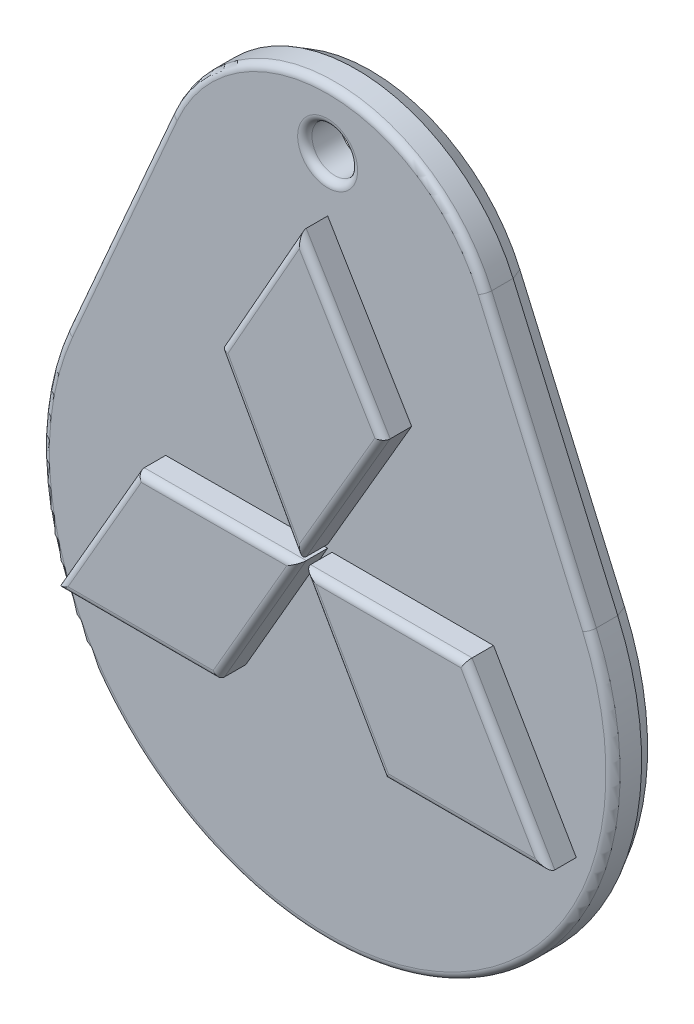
ISO-10303-21;
HEADER;
FILE_DESCRIPTION(('STEP AP214'),'2;1');
FILE_NAME('part.step','',(''),(''),'','','');
FILE_SCHEMA(('AUTOMOTIVE_DESIGN { 1 0 10303 214 1 1 1 1 }'));
ENDSEC;
DATA;
#1=APPLICATION_CONTEXT('core data for automotive mechanical design processes');
#2=APPLICATION_PROTOCOL_DEFINITION('international standard','automotive_design',2000,#1);
#3=PRODUCT_CONTEXT('',#1,'mechanical');
#4=PRODUCT('Part','Part','',(#3));
#5=PRODUCT_RELATED_PRODUCT_CATEGORY('part','',(#4));
#6=PRODUCT_DEFINITION_FORMATION('','',#4);
#7=PRODUCT_DEFINITION_CONTEXT('part definition',#1,'design');
#8=PRODUCT_DEFINITION('design','',#6,#7);
#9=PRODUCT_DEFINITION_SHAPE('','',#8);
#10=(LENGTH_UNIT() NAMED_UNIT(*) SI_UNIT(.MILLI.,.METRE.));
#11=(NAMED_UNIT(*) PLANE_ANGLE_UNIT() SI_UNIT($,.RADIAN.));
#12=(NAMED_UNIT(*) SI_UNIT($,.STERADIAN.) SOLID_ANGLE_UNIT());
#13=UNCERTAINTY_MEASURE_WITH_UNIT(LENGTH_MEASURE(1.E-05),#10,'distance_accuracy_value','');
#14=(GEOMETRIC_REPRESENTATION_CONTEXT(3) GLOBAL_UNCERTAINTY_ASSIGNED_CONTEXT((#13)) GLOBAL_UNIT_ASSIGNED_CONTEXT((#10,
#11,#12)) REPRESENTATION_CONTEXT('',''));
#15=CARTESIAN_POINT('',(0.,0.,0.));
#16=DIRECTION('',(0.,0.,1.));
#17=DIRECTION('',(1.,0.,0.));
#18=AXIS2_PLACEMENT_3D('',#15,#16,#17);
#19=CARTESIAN_POINT('',(0.,0.,0.));
#20=DIRECTION('',(0.,0.,1.));
#21=DIRECTION('',(1.,0.,0.));
#22=AXIS2_PLACEMENT_3D('',#19,#20,#21);
#23=PLANE('',#22);
#24=CARTESIAN_POINT('',(0.,27.8900839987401,0.));
#25=DIRECTION('',(0.,0.,1.));
#26=DIRECTION('',(1.,0.,0.));
#27=AXIS2_PLACEMENT_3D('',#24,#25,#26);
#28=CIRCLE('',#27,2.1);
#29=CARTESIAN_POINT('',(2.1,27.8900839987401,0.));
#30=VERTEX_POINT('',#29);
#31=EDGE_CURVE('E345',#30,#30,#28,.F.);
#32=ORIENTED_EDGE('',*,*,#31,.T.);
#33=EDGE_LOOP('',(#32));
#34=FACE_BOUND('',#33,.T.);
#35=DIRECTION('',(-0.4,0.916515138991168,0.));
#36=VECTOR('',#35,1.);
#37=CARTESIAN_POINT('',(17.8720452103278,7.8,0.));
#38=LINE('',#37,#36);
#39=CARTESIAN_POINT('',(17.8720452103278,7.8,0.));
#40=VERTEX_POINT('',#39);
#41=CARTESIAN_POINT('',(10.5399240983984,24.6,0.));
#42=VERTEX_POINT('',#41);
#43=EDGE_CURVE('E340',#40,#42,#38,.T.);
#44=ORIENTED_EDGE('',*,*,#43,.T.);
#45=CARTESIAN_POINT('',(0.,20.,0.));
#46=DIRECTION('',(0.,0.,1.));
#47=DIRECTION('',(1.,0.,0.));
#48=AXIS2_PLACEMENT_3D('',#45,#46,#47);
#49=CIRCLE('',#48,11.5);
#50=CARTESIAN_POINT('',(-10.5399240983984,24.6,0.));
#51=VERTEX_POINT('',#50);
#52=EDGE_CURVE('E342',#42,#51,#49,.T.);
#53=ORIENTED_EDGE('',*,*,#52,.T.);
#54=DIRECTION('',(-0.4,-0.916515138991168,0.));
#55=VECTOR('',#54,1.);
#56=CARTESIAN_POINT('',(-17.8720452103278,7.8,0.));
#57=LINE('',#56,#55);
#58=CARTESIAN_POINT('',(-17.8720452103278,7.8,0.));
#59=VERTEX_POINT('',#58);
#60=EDGE_CURVE('E336',#51,#59,#57,.T.);
#61=ORIENTED_EDGE('',*,*,#60,.T.);
#62=CARTESIAN_POINT('',(0.,0.,0.));
#63=DIRECTION('',(0.,0.,1.));
#64=DIRECTION('',(1.,0.,0.));
#65=AXIS2_PLACEMENT_3D('',#62,#63,#64);
#66=CIRCLE('',#65,19.5);
#67=EDGE_CURVE('E338',#59,#40,#66,.T.);
#68=ORIENTED_EDGE('',*,*,#67,.T.);
#69=EDGE_LOOP('',(#44,#53,#61,#68));
#70=FACE_BOUND('',#69,.T.);
#71=DIRECTION('',(0.499830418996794,0.866123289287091,0.));
#72=VECTOR('',#71,1.);
#73=CARTESIAN_POINT('',(0.,3.92579701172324,0.));
#74=LINE('',#73,#72);
#75=CARTESIAN_POINT('',(-5.73166134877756,-6.00622231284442,0.));
#76=VERTEX_POINT('',#75);
#77=CARTESIAN_POINT('',(0.,3.92579701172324,0.));
#78=VERTEX_POINT('',#77);
#79=EDGE_CURVE('E238',#76,#78,#74,.T.);
#80=ORIENTED_EDGE('',*,*,#79,.F.);
#81=DIRECTION('',(1.,0.,0.));
#82=VECTOR('',#81,1.);
#83=CARTESIAN_POINT('',(-5.73166134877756,-6.00622231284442,0.));
#84=LINE('',#83,#82);
#85=CARTESIAN_POINT('',(-17.0564060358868,-6.00622231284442,0.));
#86=VERTEX_POINT('',#85);
#87=EDGE_CURVE('E211',#86,#76,#84,.T.);
#88=ORIENTED_EDGE('',*,*,#87,.F.);
#89=DIRECTION('',(-0.499830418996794,-0.866123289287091,0.));
#90=VECTOR('',#89,1.);
#91=CARTESIAN_POINT('',(-17.0564060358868,-6.00622231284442,0.));
#92=LINE('',#91,#90);
#93=CARTESIAN_POINT('',(-11.3490201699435,3.88373162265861,0.));
#94=VERTEX_POINT('',#93);
#95=EDGE_CURVE('E244',#94,#86,#92,.T.);
#96=ORIENTED_EDGE('',*,*,#95,.F.);
#97=DIRECTION('',(-0.999993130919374,-0.00370649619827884,0.));
#98=VECTOR('',#97,1.);
#99=CARTESIAN_POINT('',(-11.3490201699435,3.88373162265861,0.));
#100=LINE('',#99,#98);
#101=EDGE_CURVE('E241',#78,#94,#100,.T.);
#102=ORIENTED_EDGE('',*,*,#101,.F.);
#103=EDGE_LOOP('',(#80,#88,#96,#102));
#104=FACE_BOUND('',#103,.T.);
#105=DIRECTION('',(-0.513744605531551,0.857943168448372,0.));
#106=VECTOR('',#105,1.);
#107=CARTESIAN_POINT('',(0.,24.0880424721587,0.));
#108=LINE('',#107,#106);
#109=CARTESIAN_POINT('',(5.88610091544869,14.2583722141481,0.));
#110=VERTEX_POINT('',#109);
#111=CARTESIAN_POINT('',(0.,24.0880424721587,0.));
#112=VERTEX_POINT('',#111);
#113=EDGE_CURVE('E258',#110,#112,#108,.T.);
#114=ORIENTED_EDGE('',*,*,#113,.F.);
#115=DIRECTION('',(0.503581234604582,0.86394788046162,0.));
#116=VECTOR('',#115,1.);
#117=CARTESIAN_POINT('',(5.88610091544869,14.2583722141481,0.));
#118=LINE('',#117,#116);
#119=CARTESIAN_POINT('',(0.,4.16013173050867,0.));
#120=VERTEX_POINT('',#119);
#121=EDGE_CURVE('E255',#120,#110,#118,.T.);
#122=ORIENTED_EDGE('',*,*,#121,.F.);
#123=DIRECTION('',(0.481982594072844,-0.876180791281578,0.));
#124=VECTOR('',#123,1.);
#125=CARTESIAN_POINT('',(0.,4.16013173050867,0.));
#126=LINE('',#125,#124);
#127=CARTESIAN_POINT('',(-5.55499069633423,14.2583722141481,0.));
#128=VERTEX_POINT('',#127);
#129=EDGE_CURVE('E264',#128,#120,#126,.T.);
#130=ORIENTED_EDGE('',*,*,#129,.F.);
#131=DIRECTION('',(-0.491996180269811,-0.870597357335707,0.));
#132=VECTOR('',#131,1.);
#133=CARTESIAN_POINT('',(-5.55499069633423,14.2583722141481,0.));
#134=LINE('',#133,#132);
#135=EDGE_CURVE('E261',#112,#128,#134,.T.);
#136=ORIENTED_EDGE('',*,*,#135,.F.);
#137=EDGE_LOOP('',(#114,#122,#130,#136));
#138=FACE_BOUND('',#137,.T.);
#139=DIRECTION('',(1.,0.,0.));
#140=VECTOR('',#139,1.);
#141=CARTESIAN_POINT('',(17.4213878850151,-6.13664329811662,0.));
#142=LINE('',#141,#140);
#143=CARTESIAN_POINT('',(5.96399868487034,-6.13664329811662,0.));
#144=VERTEX_POINT('',#143);
#145=CARTESIAN_POINT('',(17.4213878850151,-6.13664329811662,0.));
#146=VERTEX_POINT('',#145);
#147=EDGE_CURVE('E205',#144,#146,#142,.T.);
#148=ORIENTED_EDGE('',*,*,#147,.F.);
#149=DIRECTION('',(0.493633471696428,-0.869670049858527,0.));
#150=VECTOR('',#149,1.);
#151=CARTESIAN_POINT('',(5.96399868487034,-6.13664329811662,0.));
#152=LINE('',#151,#150);
#153=CARTESIAN_POINT('',(0.30583520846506,3.83175551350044,0.));
#154=VERTEX_POINT('',#153);
#155=EDGE_CURVE('E215',#154,#144,#152,.T.);
#156=ORIENTED_EDGE('',*,*,#155,.F.);
#157=DIRECTION('',(-1.,0.,0.));
#158=VECTOR('',#157,1.);
#159=CARTESIAN_POINT('',(0.30583520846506,3.83175551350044,0.));
#160=LINE('',#159,#158);
#161=CARTESIAN_POINT('',(11.6221621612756,3.83175551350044,0.));
#162=VERTEX_POINT('',#161);
#163=EDGE_CURVE('E227',#162,#154,#160,.T.);
#164=ORIENTED_EDGE('',*,*,#163,.F.);
#165=DIRECTION('',(-0.502856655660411,0.864369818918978,0.));
#166=VECTOR('',#165,1.);
#167=CARTESIAN_POINT('',(11.6221621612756,3.83175551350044,0.));
#168=LINE('',#167,#166);
#169=EDGE_CURVE('E225',#146,#162,#168,.T.);
#170=ORIENTED_EDGE('',*,*,#169,.F.);
#171=EDGE_LOOP('',(#148,#156,#164,#170));
#172=FACE_BOUND('',#171,.T.);
#173=ADVANCED_FACE('F26',(#34,#70,#104,#138,#172),#23,.T.);
#174=CARTESIAN_POINT('',(0.,0.,-3.));
#175=DIRECTION('',(0.,0.,1.));
#176=DIRECTION('',(1.,0.,0.));
#177=AXIS2_PLACEMENT_3D('',#174,#175,#176);
#178=CYLINDRICAL_SURFACE('',#177,20.);
#179=DIRECTION('',(0.,0.,1.));
#180=VECTOR('',#179,1.);
#181=CARTESIAN_POINT('',(-18.3303027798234,8.,-3.));
#182=LINE('',#181,#180);
#183=CARTESIAN_POINT('',(-18.3303027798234,8.,-2.00000000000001));
#184=VERTEX_POINT('',#183);
#185=CARTESIAN_POINT('',(-18.3303027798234,8.,-0.5));
#186=VERTEX_POINT('',#185);
#187=EDGE_CURVE('E276',#184,#186,#182,.T.);
#188=ORIENTED_EDGE('',*,*,#187,.F.);
#189=CARTESIAN_POINT('',(0.,0.,-2.00000000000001));
#190=DIRECTION('',(0.,0.,1.));
#191=DIRECTION('',(1.,0.,0.));
#192=AXIS2_PLACEMENT_3D('',#189,#190,#191);
#193=CIRCLE('',#192,20.);
#194=CARTESIAN_POINT('',(18.3303027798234,8.,-2.00000000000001));
#195=VERTEX_POINT('',#194);
#196=EDGE_CURVE('E34',#184,#195,#193,.T.);
#197=ORIENTED_EDGE('',*,*,#196,.T.);
#198=DIRECTION('',(0.,0.,1.));
#199=VECTOR('',#198,1.);
#200=CARTESIAN_POINT('',(18.3303027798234,8.,-3.));
#201=LINE('',#200,#199);
#202=CARTESIAN_POINT('',(18.3303027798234,8.,-0.5));
#203=VERTEX_POINT('',#202);
#204=EDGE_CURVE('E275',#195,#203,#201,.T.);
#205=ORIENTED_EDGE('',*,*,#204,.T.);
#206=CARTESIAN_POINT('',(0.,0.,-0.5));
#207=DIRECTION('',(0.,0.,1.));
#208=DIRECTION('',(1.,0.,0.));
#209=AXIS2_PLACEMENT_3D('',#206,#207,#208);
#210=CIRCLE('',#209,20.);
#211=EDGE_CURVE('E354',#203,#186,#210,.F.);
#212=ORIENTED_EDGE('',*,*,#211,.T.);
#213=EDGE_LOOP('',(#188,#197,#205,#212));
#214=FACE_BOUND('',#213,.T.);
#215=ADVANCED_FACE('F28',(#214),#178,.T.);
#216=CARTESIAN_POINT('',(-10.998181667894,24.8,-3.));
#217=DIRECTION('',(-0.916515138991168,0.4,0.));
#218=DIRECTION('',(-0.4,-0.916515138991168,0.));
#219=AXIS2_PLACEMENT_3D('',#216,#217,#218);
#220=PLANE('',#219);
#221=DIRECTION('',(0.,0.,1.));
#222=VECTOR('',#221,1.);
#223=CARTESIAN_POINT('',(-10.998181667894,24.8,-3.));
#224=LINE('',#223,#222);
#225=CARTESIAN_POINT('',(-10.998181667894,24.8,-2.00000000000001));
#226=VERTEX_POINT('',#225);
#227=CARTESIAN_POINT('',(-10.998181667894,24.8,-0.5));
#228=VERTEX_POINT('',#227);
#229=EDGE_CURVE('E279',#226,#228,#224,.T.);
#230=ORIENTED_EDGE('',*,*,#229,.F.);
#231=DIRECTION('',(-0.4,-0.916515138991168,0.));
#232=VECTOR('',#231,1.);
#233=CARTESIAN_POINT('',(-18.3303027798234,8.,-2.00000000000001));
#234=LINE('',#233,#232);
#235=EDGE_CURVE('E41',#226,#184,#234,.T.);
#236=ORIENTED_EDGE('',*,*,#235,.T.);
#237=ORIENTED_EDGE('',*,*,#187,.T.);
#238=DIRECTION('',(-0.4,-0.916515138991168,0.));
#239=VECTOR('',#238,1.);
#240=CARTESIAN_POINT('',(-10.998181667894,24.8,-0.5));
#241=LINE('',#240,#239);
#242=EDGE_CURVE('E360',#186,#228,#241,.F.);
#243=ORIENTED_EDGE('',*,*,#242,.T.);
#244=EDGE_LOOP('',(#230,#236,#237,#243));
#245=FACE_BOUND('',#244,.T.);
#246=ADVANCED_FACE('F491',(#245),#220,.T.);
#247=CARTESIAN_POINT('',(0.,20.,-3.));
#248=DIRECTION('',(0.,0.,1.));
#249=DIRECTION('',(1.,0.,0.));
#250=AXIS2_PLACEMENT_3D('',#247,#248,#249);
#251=CYLINDRICAL_SURFACE('',#250,12.);
#252=DIRECTION('',(0.,0.,1.));
#253=VECTOR('',#252,1.);
#254=CARTESIAN_POINT('',(10.998181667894,24.8,-3.));
#255=LINE('',#254,#253);
#256=CARTESIAN_POINT('',(10.998181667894,24.8,-2.00000000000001));
#257=VERTEX_POINT('',#256);
#258=CARTESIAN_POINT('',(10.998181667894,24.8,-0.5));
#259=VERTEX_POINT('',#258);
#260=EDGE_CURVE('E281',#257,#259,#255,.T.);
#261=ORIENTED_EDGE('',*,*,#260,.F.);
#262=CARTESIAN_POINT('',(0.,20.,-2.00000000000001));
#263=DIRECTION('',(0.,0.,1.));
#264=DIRECTION('',(1.,0.,0.));
#265=AXIS2_PLACEMENT_3D('',#262,#263,#264);
#266=CIRCLE('',#265,12.);
#267=EDGE_CURVE('E49',#257,#226,#266,.T.);
#268=ORIENTED_EDGE('',*,*,#267,.T.);
#269=ORIENTED_EDGE('',*,*,#229,.T.);
#270=CARTESIAN_POINT('',(0.,20.,-0.5));
#271=DIRECTION('',(0.,0.,1.));
#272=DIRECTION('',(1.,0.,0.));
#273=AXIS2_PLACEMENT_3D('',#270,#271,#272);
#274=CIRCLE('',#273,12.);
#275=EDGE_CURVE('E348',#228,#259,#274,.F.);
#276=ORIENTED_EDGE('',*,*,#275,.T.);
#277=EDGE_LOOP('',(#261,#268,#269,#276));
#278=FACE_BOUND('',#277,.T.);
#279=ADVANCED_FACE('F503',(#278),#251,.T.);
#280=CARTESIAN_POINT('',(10.998181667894,24.8,-3.));
#281=DIRECTION('',(0.916515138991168,0.4,0.));
#282=DIRECTION('',(-0.4,0.916515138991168,0.));
#283=AXIS2_PLACEMENT_3D('',#280,#281,#282);
#284=PLANE('',#283);
#285=ORIENTED_EDGE('',*,*,#204,.F.);
#286=DIRECTION('',(-0.4,0.916515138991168,0.));
#287=VECTOR('',#286,1.);
#288=CARTESIAN_POINT('',(10.998181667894,24.8,-2.00000000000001));
#289=LINE('',#288,#287);
#290=EDGE_CURVE('E363',#195,#257,#289,.T.);
#291=ORIENTED_EDGE('',*,*,#290,.T.);
#292=ORIENTED_EDGE('',*,*,#260,.T.);
#293=DIRECTION('',(-0.4,0.916515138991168,0.));
#294=VECTOR('',#293,1.);
#295=CARTESIAN_POINT('',(10.998181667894,24.8,-0.5));
#296=LINE('',#295,#294);
#297=EDGE_CURVE('E351',#259,#203,#296,.F.);
#298=ORIENTED_EDGE('',*,*,#297,.T.);
#299=EDGE_LOOP('',(#285,#291,#292,#298));
#300=FACE_BOUND('',#299,.T.);
#301=ADVANCED_FACE('F387',(#300),#284,.T.);
#302=CARTESIAN_POINT('',(0.,0.,-3.));
#303=DIRECTION('',(0.,0.,1.));
#304=DIRECTION('',(1.,0.,0.));
#305=AXIS2_PLACEMENT_3D('',#302,#303,#304);
#306=PLANE('',#305);
#307=CARTESIAN_POINT('',(0.,20.,-3.));
#308=DIRECTION('',(0.,0.,1.));
#309=DIRECTION('',(1.,0.,0.));
#310=AXIS2_PLACEMENT_3D('',#307,#308,#309);
#311=CIRCLE('',#310,11.4226497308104);
#312=CARTESIAN_POINT('',(-10.4690314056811,24.5690598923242,-3.));
#313=VERTEX_POINT('',#312);
#314=CARTESIAN_POINT('',(10.4690314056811,24.5690598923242,-3.));
#315=VERTEX_POINT('',#314);
#316=EDGE_CURVE('E373',#313,#315,#311,.F.);
#317=ORIENTED_EDGE('',*,*,#316,.T.);
#318=DIRECTION('',(0.4,-0.916515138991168,0.));
#319=VECTOR('',#318,1.);
#320=CARTESIAN_POINT('',(17.8011525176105,7.76905989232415,-3.));
#321=LINE('',#320,#319);
#322=CARTESIAN_POINT('',(17.8011525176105,7.76905989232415,-3.));
#323=VERTEX_POINT('',#322);
#324=EDGE_CURVE('E375',#315,#323,#321,.T.);
#325=ORIENTED_EDGE('',*,*,#324,.T.);
#326=CARTESIAN_POINT('',(0.,0.,-3.));
#327=DIRECTION('',(0.,0.,1.));
#328=DIRECTION('',(1.,0.,0.));
#329=AXIS2_PLACEMENT_3D('',#326,#327,#328);
#330=CIRCLE('',#329,19.4226497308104);
#331=CARTESIAN_POINT('',(-17.8011525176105,7.76905989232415,-3.));
#332=VERTEX_POINT('',#331);
#333=EDGE_CURVE('E369',#323,#332,#330,.F.);
#334=ORIENTED_EDGE('',*,*,#333,.T.);
#335=DIRECTION('',(0.4,0.916515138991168,0.));
#336=VECTOR('',#335,1.);
#337=CARTESIAN_POINT('',(-10.4690314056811,24.5690598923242,-3.));
#338=LINE('',#337,#336);
#339=EDGE_CURVE('E371',#332,#313,#338,.T.);
#340=ORIENTED_EDGE('',*,*,#339,.T.);
#341=EDGE_LOOP('',(#317,#325,#334,#340));
#342=FACE_BOUND('',#341,.T.);
#343=CARTESIAN_POINT('',(0.,27.8900839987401,-3.));
#344=DIRECTION('',(0.,0.,1.));
#345=DIRECTION('',(1.,0.,0.));
#346=AXIS2_PLACEMENT_3D('',#343,#344,#345);
#347=CIRCLE('',#346,2.60000000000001);
#348=CARTESIAN_POINT('',(2.60000000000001,27.8900839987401,-3.));
#349=VERTEX_POINT('',#348);
#350=EDGE_CURVE('E366',#349,#349,#347,.T.);
#351=ORIENTED_EDGE('',*,*,#350,.T.);
#352=EDGE_LOOP('',(#351));
#353=FACE_BOUND('',#352,.T.);
#354=ADVANCED_FACE('F497',(#342,#353),#306,.F.);
#355=CARTESIAN_POINT('',(5.88610091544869,14.2583722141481,2.));
#356=DIRECTION('',(-0.86394788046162,0.503581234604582,0.));
#357=DIRECTION('',(-0.503581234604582,-0.86394788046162,0.));
#358=AXIS2_PLACEMENT_3D('',#355,#356,#357);
#359=PLANE('',#358);
#360=DIRECTION('',(0.,0.,-1.));
#361=VECTOR('',#360,1.);
#362=CARTESIAN_POINT('',(5.88610091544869,14.2583722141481,2.));
#363=LINE('',#362,#361);
#364=CARTESIAN_POINT('',(5.88610091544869,14.2583722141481,1.5));
#365=VERTEX_POINT('',#364);
#366=EDGE_CURVE('E273',#365,#110,#363,.T.);
#367=ORIENTED_EDGE('',*,*,#366,.F.);
#368=DIRECTION('',(0.503581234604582,0.86394788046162,0.));
#369=VECTOR('',#368,1.);
#370=CARTESIAN_POINT('',(0.,4.16013173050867,1.5));
#371=LINE('',#370,#369);
#372=CARTESIAN_POINT('',(0.,4.16013173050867,1.5));
#373=VERTEX_POINT('',#372);
#374=EDGE_CURVE('E316',#365,#373,#371,.F.);
#375=ORIENTED_EDGE('',*,*,#374,.T.);
#376=DIRECTION('',(0.,0.,-1.));
#377=VECTOR('',#376,1.);
#378=CARTESIAN_POINT('',(0.,4.16013173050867,2.));
#379=LINE('',#378,#377);
#380=EDGE_CURVE('E267',#373,#120,#379,.T.);
#381=ORIENTED_EDGE('',*,*,#380,.T.);
#382=ORIENTED_EDGE('',*,*,#121,.T.);
#383=EDGE_LOOP('',(#367,#375,#381,#382));
#384=FACE_BOUND('',#383,.T.);
#385=ADVANCED_FACE('F495',(#384),#359,.F.);
#386=CARTESIAN_POINT('',(0.,24.0880424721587,2.));
#387=DIRECTION('',(-0.857943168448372,-0.513744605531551,0.));
#388=DIRECTION('',(0.513744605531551,-0.857943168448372,0.));
#389=AXIS2_PLACEMENT_3D('',#386,#387,#388);
#390=PLANE('',#389);
#391=DIRECTION('',(0.,0.,-1.));
#392=VECTOR('',#391,1.);
#393=CARTESIAN_POINT('',(0.,24.0880424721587,2.));
#394=LINE('',#393,#392);
#395=CARTESIAN_POINT('',(0.,24.0880424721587,1.5));
#396=VERTEX_POINT('',#395);
#397=EDGE_CURVE('E271',#396,#112,#394,.T.);
#398=ORIENTED_EDGE('',*,*,#397,.F.);
#399=DIRECTION('',(-0.513744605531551,0.857943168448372,0.));
#400=VECTOR('',#399,1.);
#401=CARTESIAN_POINT('',(5.88610091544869,14.2583722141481,1.5));
#402=LINE('',#401,#400);
#403=EDGE_CURVE('E314',#396,#365,#402,.F.);
#404=ORIENTED_EDGE('',*,*,#403,.T.);
#405=ORIENTED_EDGE('',*,*,#366,.T.);
#406=ORIENTED_EDGE('',*,*,#113,.T.);
#407=EDGE_LOOP('',(#398,#404,#405,#406));
#408=FACE_BOUND('',#407,.T.);
#409=ADVANCED_FACE('F756',(#408),#390,.F.);
#410=CARTESIAN_POINT('',(-5.55499069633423,14.2583722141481,2.));
#411=DIRECTION('',(0.870597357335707,-0.491996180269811,0.));
#412=DIRECTION('',(0.491996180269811,0.870597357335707,0.));
#413=AXIS2_PLACEMENT_3D('',#410,#411,#412);
#414=PLANE('',#413);
#415=DIRECTION('',(0.,0.,-1.));
#416=VECTOR('',#415,1.);
#417=CARTESIAN_POINT('',(-5.55499069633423,14.2583722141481,2.));
#418=LINE('',#417,#416);
#419=CARTESIAN_POINT('',(-5.55499069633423,14.2583722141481,1.5));
#420=VERTEX_POINT('',#419);
#421=EDGE_CURVE('E269',#420,#128,#418,.T.);
#422=ORIENTED_EDGE('',*,*,#421,.F.);
#423=DIRECTION('',(-0.491996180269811,-0.870597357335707,0.));
#424=VECTOR('',#423,1.);
#425=CARTESIAN_POINT('',(0.,24.0880424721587,1.5));
#426=LINE('',#425,#424);
#427=EDGE_CURVE('E312',#420,#396,#426,.F.);
#428=ORIENTED_EDGE('',*,*,#427,.T.);
#429=ORIENTED_EDGE('',*,*,#397,.T.);
#430=ORIENTED_EDGE('',*,*,#135,.T.);
#431=EDGE_LOOP('',(#422,#428,#429,#430));
#432=FACE_BOUND('',#431,.T.);
#433=ADVANCED_FACE('F748',(#432),#414,.F.);
#434=CARTESIAN_POINT('',(0.,4.16013173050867,2.));
#435=DIRECTION('',(0.876180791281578,0.481982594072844,0.));
#436=DIRECTION('',(-0.481982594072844,0.876180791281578,0.));
#437=AXIS2_PLACEMENT_3D('',#434,#435,#436);
#438=PLANE('',#437);
#439=ORIENTED_EDGE('',*,*,#380,.F.);
#440=DIRECTION('',(0.481982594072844,-0.876180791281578,0.));
#441=VECTOR('',#440,1.);
#442=CARTESIAN_POINT('',(-5.55499069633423,14.2583722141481,1.5));
#443=LINE('',#442,#441);
#444=EDGE_CURVE('E309',#373,#420,#443,.F.);
#445=ORIENTED_EDGE('',*,*,#444,.T.);
#446=ORIENTED_EDGE('',*,*,#421,.T.);
#447=ORIENTED_EDGE('',*,*,#129,.T.);
#448=EDGE_LOOP('',(#439,#445,#446,#447));
#449=FACE_BOUND('',#448,.T.);
#450=ADVANCED_FACE('F740',(#449),#438,.F.);
#451=CARTESIAN_POINT('',(5.88610091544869,14.2583722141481,2.));
#452=DIRECTION('',(0.,0.,1.));
#453=DIRECTION('',(1.,0.,0.));
#454=AXIS2_PLACEMENT_3D('',#451,#452,#453);
#455=PLANE('',#454);
#456=DIRECTION('',(-0.491996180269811,-0.870597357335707,0.));
#457=VECTOR('',#456,1.);
#458=CARTESIAN_POINT('',(-5.11969201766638,14.0123741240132,2.));
#459=LINE('',#458,#457);
#460=CARTESIAN_POINT('',(0.0125081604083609,23.0939078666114,2.));
#461=VERTEX_POINT('',#460);
#462=CARTESIAN_POINT('',(-4.98252696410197,14.2550905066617,2.));
#463=VERTEX_POINT('',#462);
#464=EDGE_CURVE('E304',#461,#463,#459,.T.);
#465=ORIENTED_EDGE('',*,*,#464,.T.);
#466=DIRECTION('',(0.481982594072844,-0.876180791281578,0.));
#467=VECTOR('',#466,1.);
#468=CARTESIAN_POINT('',(0.43809039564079,4.40112302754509,2.));
#469=LINE('',#468,#467);
#470=CARTESIAN_POINT('',(0.0125919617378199,5.17462306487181,2.));
#471=VERTEX_POINT('',#470);
#472=EDGE_CURVE('E306',#463,#471,#469,.T.);
#473=ORIENTED_EDGE('',*,*,#472,.T.);
#474=DIRECTION('',(0.503581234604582,0.86394788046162,0.));
#475=VECTOR('',#474,1.);
#476=CARTESIAN_POINT('',(5.45412697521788,14.5101628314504,2.));
#477=LINE('',#476,#475);
#478=CARTESIAN_POINT('',(5.3053643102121,14.2549444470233,2.));
#479=VERTEX_POINT('',#478);
#480=EDGE_CURVE('E300',#471,#479,#477,.T.);
#481=ORIENTED_EDGE('',*,*,#480,.T.);
#482=DIRECTION('',(-0.513744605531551,0.857943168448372,0.));
#483=VECTOR('',#482,1.);
#484=CARTESIAN_POINT('',(-0.428971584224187,23.831170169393,2.));
#485=LINE('',#484,#483);
#486=EDGE_CURVE('E302',#479,#461,#485,.T.);
#487=ORIENTED_EDGE('',*,*,#486,.T.);
#488=EDGE_LOOP('',(#465,#473,#481,#487));
#489=FACE_BOUND('',#488,.T.);
#490=ADVANCED_FACE('F732',(#489),#455,.T.);
#491=CARTESIAN_POINT('',(-5.73166134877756,-6.00622231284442,2.));
#492=DIRECTION('',(0.,1.,0.));
#493=DIRECTION('',(0.,0.,1.));
#494=AXIS2_PLACEMENT_3D('',#491,#492,#493);
#495=PLANE('',#494);
#496=DIRECTION('',(0.,0.,-1.));
#497=VECTOR('',#496,1.);
#498=CARTESIAN_POINT('',(-5.73166134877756,-6.00622231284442,2.));
#499=LINE('',#498,#497);
#500=CARTESIAN_POINT('',(-5.73166134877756,-6.00622231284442,1.5));
#501=VERTEX_POINT('',#500);
#502=EDGE_CURVE('E253',#501,#76,#499,.T.);
#503=ORIENTED_EDGE('',*,*,#502,.F.);
#504=DIRECTION('',(1.,0.,0.));
#505=VECTOR('',#504,1.);
#506=CARTESIAN_POINT('',(-17.0564060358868,-6.00622231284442,1.5));
#507=LINE('',#506,#505);
#508=CARTESIAN_POINT('',(-17.0564060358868,-6.00622231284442,1.5));
#509=VERTEX_POINT('',#508);
#510=EDGE_CURVE('E334',#501,#509,#507,.F.);
#511=ORIENTED_EDGE('',*,*,#510,.T.);
#512=DIRECTION('',(0.,0.,-1.));
#513=VECTOR('',#512,1.);
#514=CARTESIAN_POINT('',(-17.0564060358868,-6.00622231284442,2.));
#515=LINE('',#514,#513);
#516=EDGE_CURVE('E247',#509,#86,#515,.T.);
#517=ORIENTED_EDGE('',*,*,#516,.T.);
#518=ORIENTED_EDGE('',*,*,#87,.T.);
#519=EDGE_LOOP('',(#503,#511,#517,#518));
#520=FACE_BOUND('',#519,.T.);
#521=ADVANCED_FACE('F724',(#520),#495,.F.);
#522=CARTESIAN_POINT('',(0.,3.92579701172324,2.));
#523=DIRECTION('',(-0.866123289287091,0.499830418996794,0.));
#524=DIRECTION('',(-0.499830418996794,-0.866123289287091,0.));
#525=AXIS2_PLACEMENT_3D('',#522,#523,#524);
#526=PLANE('',#525);
#527=DIRECTION('',(0.,0.,-1.));
#528=VECTOR('',#527,1.);
#529=CARTESIAN_POINT('',(0.,3.92579701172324,2.));
#530=LINE('',#529,#528);
#531=CARTESIAN_POINT('',(0.,3.92579701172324,1.5));
#532=VERTEX_POINT('',#531);
#533=EDGE_CURVE('E251',#532,#78,#530,.T.);
#534=ORIENTED_EDGE('',*,*,#533,.F.);
#535=DIRECTION('',(0.499830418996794,0.866123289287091,0.));
#536=VECTOR('',#535,1.);
#537=CARTESIAN_POINT('',(-5.73166134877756,-6.00622231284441,1.5));
#538=LINE('',#537,#536);
#539=EDGE_CURVE('E332',#532,#501,#538,.F.);
#540=ORIENTED_EDGE('',*,*,#539,.T.);
#541=ORIENTED_EDGE('',*,*,#502,.T.);
#542=ORIENTED_EDGE('',*,*,#79,.T.);
#543=EDGE_LOOP('',(#534,#540,#541,#542));
#544=FACE_BOUND('',#543,.T.);
#545=ADVANCED_FACE('F716',(#544),#526,.F.);
#546=CARTESIAN_POINT('',(-11.3490201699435,3.88373162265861,2.));
#547=DIRECTION('',(0.00370649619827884,-0.999993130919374,0.));
#548=DIRECTION('',(0.999993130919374,0.00370649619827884,0.));
#549=AXIS2_PLACEMENT_3D('',#546,#547,#548);
#550=PLANE('',#549);
#551=DIRECTION('',(0.,0.,-1.));
#552=VECTOR('',#551,1.);
#553=CARTESIAN_POINT('',(-11.3490201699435,3.88373162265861,2.));
#554=LINE('',#553,#552);
#555=CARTESIAN_POINT('',(-11.3490201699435,3.88373162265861,1.5));
#556=VERTEX_POINT('',#555);
#557=EDGE_CURVE('E249',#556,#94,#554,.T.);
#558=ORIENTED_EDGE('',*,*,#557,.F.);
#559=DIRECTION('',(-0.999993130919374,-0.00370649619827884,0.));
#560=VECTOR('',#559,1.);
#561=CARTESIAN_POINT('',(0.,3.92579701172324,1.5));
#562=LINE('',#561,#560);
#563=EDGE_CURVE('E330',#556,#532,#562,.F.);
#564=ORIENTED_EDGE('',*,*,#563,.T.);
#565=ORIENTED_EDGE('',*,*,#533,.T.);
#566=ORIENTED_EDGE('',*,*,#101,.T.);
#567=EDGE_LOOP('',(#558,#564,#565,#566));
#568=FACE_BOUND('',#567,.T.);
#569=ADVANCED_FACE('F708',(#568),#550,.F.);
#570=CARTESIAN_POINT('',(-17.0564060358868,-6.00622231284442,2.));
#571=DIRECTION('',(0.866123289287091,-0.499830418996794,0.));
#572=DIRECTION('',(0.499830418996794,0.866123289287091,0.));
#573=AXIS2_PLACEMENT_3D('',#570,#571,#572);
#574=PLANE('',#573);
#575=ORIENTED_EDGE('',*,*,#516,.F.);
#576=DIRECTION('',(-0.499830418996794,-0.866123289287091,0.));
#577=VECTOR('',#576,1.);
#578=CARTESIAN_POINT('',(-11.3490201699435,3.88373162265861,1.5));
#579=LINE('',#578,#577);
#580=EDGE_CURVE('E327',#509,#556,#579,.F.);
#581=ORIENTED_EDGE('',*,*,#580,.T.);
#582=ORIENTED_EDGE('',*,*,#557,.T.);
#583=ORIENTED_EDGE('',*,*,#95,.T.);
#584=EDGE_LOOP('',(#575,#581,#582,#583));
#585=FACE_BOUND('',#584,.T.);
#586=ADVANCED_FACE('F700',(#585),#574,.F.);
#587=CARTESIAN_POINT('',(-5.73166134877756,-6.00622231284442,2.));
#588=DIRECTION('',(0.,0.,1.));
#589=DIRECTION('',(1.,0.,0.));
#590=AXIS2_PLACEMENT_3D('',#587,#588,#589);
#591=PLANE('',#590);
#592=DIRECTION('',(-0.999993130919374,-0.00370649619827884,0.));
#593=VECTOR('',#592,1.);
#594=CARTESIAN_POINT('',(-11.3471669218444,3.38373505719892,2.));
#595=LINE('',#594,#593);
#596=CARTESIAN_POINT('',(-0.867687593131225,3.42257747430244,2.));
#597=VERTEX_POINT('',#596);
#598=CARTESIAN_POINT('',(-11.0596628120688,3.38480069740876,2.));
#599=VERTEX_POINT('',#598);
#600=EDGE_CURVE('E322',#597,#599,#595,.T.);
#601=ORIENTED_EDGE('',*,*,#600,.T.);
#602=DIRECTION('',(-0.499830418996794,-0.866123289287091,0.));
#603=VECTOR('',#602,1.);
#604=CARTESIAN_POINT('',(-16.6233443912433,-6.25613752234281,2.));
#605=LINE('',#604,#603);
#606=CARTESIAN_POINT('',(-16.1905764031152,-5.50622231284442,2.));
#607=VERTEX_POINT('',#606);
#608=EDGE_CURVE('E324',#599,#607,#605,.T.);
#609=ORIENTED_EDGE('',*,*,#608,.T.);
#610=DIRECTION('',(1.,0.,0.));
#611=VECTOR('',#610,1.);
#612=CARTESIAN_POINT('',(-5.73166134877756,-5.50622231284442,2.));
#613=LINE('',#612,#611);
#614=CARTESIAN_POINT('',(-6.02040175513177,-5.50622231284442,2.));
#615=VERTEX_POINT('',#614);
#616=EDGE_CURVE('E318',#607,#615,#613,.T.);
#617=ORIENTED_EDGE('',*,*,#616,.T.);
#618=DIRECTION('',(0.499830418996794,0.866123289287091,0.));
#619=VECTOR('',#618,1.);
#620=CARTESIAN_POINT('',(-0.433061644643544,4.17571222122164,2.));
#621=LINE('',#620,#619);
#622=EDGE_CURVE('E320',#615,#597,#621,.T.);
#623=ORIENTED_EDGE('',*,*,#622,.T.);
#624=EDGE_LOOP('',(#601,#609,#617,#623));
#625=FACE_BOUND('',#624,.T.);
#626=ADVANCED_FACE('F690',(#625),#591,.T.);
#627=CARTESIAN_POINT('',(5.96399868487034,-6.13664329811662,2.));
#628=DIRECTION('',(0.869670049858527,0.493633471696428,0.));
#629=DIRECTION('',(-0.493633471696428,0.869670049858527,0.));
#630=AXIS2_PLACEMENT_3D('',#627,#628,#629);
#631=PLANE('',#630);
#632=DIRECTION('',(0.,0.,-1.));
#633=VECTOR('',#632,1.);
#634=CARTESIAN_POINT('',(5.96399868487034,-6.13664329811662,2.));
#635=LINE('',#634,#633);
#636=CARTESIAN_POINT('',(5.96399868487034,-6.13664329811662,1.5));
#637=VERTEX_POINT('',#636);
#638=EDGE_CURVE('E200',#637,#144,#635,.T.);
#639=ORIENTED_EDGE('',*,*,#638,.F.);
#640=DIRECTION('',(0.493633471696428,-0.869670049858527,0.));
#641=VECTOR('',#640,1.);
#642=CARTESIAN_POINT('',(0.305835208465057,3.83175551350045,1.5));
#643=LINE('',#642,#641);
#644=CARTESIAN_POINT('',(0.30583520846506,3.83175551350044,1.5));
#645=VERTEX_POINT('',#644);
#646=EDGE_CURVE('E298',#637,#645,#643,.F.);
#647=ORIENTED_EDGE('',*,*,#646,.T.);
#648=DIRECTION('',(0.,0.,-1.));
#649=VECTOR('',#648,1.);
#650=CARTESIAN_POINT('',(0.30583520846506,3.83175551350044,2.));
#651=LINE('',#650,#649);
#652=EDGE_CURVE('E218',#645,#154,#651,.T.);
#653=ORIENTED_EDGE('',*,*,#652,.T.);
#654=ORIENTED_EDGE('',*,*,#155,.T.);
#655=EDGE_LOOP('',(#639,#647,#653,#654));
#656=FACE_BOUND('',#655,.T.);
#657=ADVANCED_FACE('F216',(#656),#631,.F.);
#658=CARTESIAN_POINT('',(17.4213878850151,-6.13664329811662,2.));
#659=DIRECTION('',(0.,1.,0.));
#660=DIRECTION('',(0.,0.,1.));
#661=AXIS2_PLACEMENT_3D('',#658,#659,#660);
#662=PLANE('',#661);
#663=DIRECTION('',(0.,0.,-1.));
#664=VECTOR('',#663,1.);
#665=CARTESIAN_POINT('',(17.4213878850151,-6.13664329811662,2.));
#666=LINE('',#665,#664);
#667=CARTESIAN_POINT('',(17.4213878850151,-6.13664329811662,1.5));
#668=VERTEX_POINT('',#667);
#669=EDGE_CURVE('E212',#668,#146,#666,.T.);
#670=ORIENTED_EDGE('',*,*,#669,.F.);
#671=DIRECTION('',(1.,0.,0.));
#672=VECTOR('',#671,1.);
#673=CARTESIAN_POINT('',(5.96399868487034,-6.13664329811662,1.5));
#674=LINE('',#673,#672);
#675=EDGE_CURVE('E208',#668,#637,#674,.F.);
#676=ORIENTED_EDGE('',*,*,#675,.T.);
#677=ORIENTED_EDGE('',*,*,#638,.T.);
#678=ORIENTED_EDGE('',*,*,#147,.T.);
#679=EDGE_LOOP('',(#670,#676,#677,#678));
#680=FACE_BOUND('',#679,.T.);
#681=ADVANCED_FACE('F203',(#680),#662,.F.);
#682=CARTESIAN_POINT('',(11.6221621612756,3.83175551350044,2.));
#683=DIRECTION('',(-0.864369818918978,-0.502856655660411,0.));
#684=DIRECTION('',(0.502856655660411,-0.864369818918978,0.));
#685=AXIS2_PLACEMENT_3D('',#682,#683,#684);
#686=PLANE('',#685);
#687=DIRECTION('',(0.,0.,-1.));
#688=VECTOR('',#687,1.);
#689=CARTESIAN_POINT('',(11.6221621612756,3.83175551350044,2.));
#690=LINE('',#689,#688);
#691=CARTESIAN_POINT('',(11.6221621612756,3.83175551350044,1.5));
#692=VERTEX_POINT('',#691);
#693=EDGE_CURVE('E233',#692,#162,#690,.T.);
#694=ORIENTED_EDGE('',*,*,#693,.F.);
#695=DIRECTION('',(-0.502856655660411,0.864369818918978,0.));
#696=VECTOR('',#695,1.);
#697=CARTESIAN_POINT('',(17.4213878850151,-6.13664329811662,1.5));
#698=LINE('',#697,#696);
#699=EDGE_CURVE('E295',#692,#668,#698,.F.);
#700=ORIENTED_EDGE('',*,*,#699,.T.);
#701=ORIENTED_EDGE('',*,*,#669,.T.);
#702=ORIENTED_EDGE('',*,*,#169,.T.);
#703=EDGE_LOOP('',(#694,#700,#701,#702));
#704=FACE_BOUND('',#703,.T.);
#705=ADVANCED_FACE('F481',(#704),#686,.F.);
#706=CARTESIAN_POINT('',(0.30583520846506,3.83175551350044,2.));
#707=DIRECTION('',(0.,-1.,0.));
#708=DIRECTION('',(0.,0.,-1.));
#709=AXIS2_PLACEMENT_3D('',#706,#707,#708);
#710=PLANE('',#709);
#711=ORIENTED_EDGE('',*,*,#652,.F.);
#712=DIRECTION('',(-1.,0.,0.));
#713=VECTOR('',#712,1.);
#714=CARTESIAN_POINT('',(11.6221621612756,3.83175551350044,1.5));
#715=LINE('',#714,#713);
#716=EDGE_CURVE('E292',#645,#692,#715,.F.);
#717=ORIENTED_EDGE('',*,*,#716,.T.);
#718=ORIENTED_EDGE('',*,*,#693,.T.);
#719=ORIENTED_EDGE('',*,*,#163,.T.);
#720=EDGE_LOOP('',(#711,#717,#718,#719));
#721=FACE_BOUND('',#720,.T.);
#722=ADVANCED_FACE('F467',(#721),#710,.F.);
#723=CARTESIAN_POINT('',(5.96399868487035,-6.13664329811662,2.));
#724=DIRECTION('',(0.,0.,1.));
#725=DIRECTION('',(1.,0.,0.));
#726=AXIS2_PLACEMENT_3D('',#723,#724,#725);
#727=PLANE('',#726);
#728=DIRECTION('',(-0.502856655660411,0.864369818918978,0.));
#729=VECTOR('',#728,1.);
#730=CARTESIAN_POINT('',(11.1899772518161,3.58032718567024,2.));
#731=LINE('',#730,#729);
#732=CARTESIAN_POINT('',(16.5520512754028,-5.63664329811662,2.));
#733=VERTEX_POINT('',#732);
#734=CARTESIAN_POINT('',(11.3345865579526,3.33175551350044,2.));
#735=VERTEX_POINT('',#734);
#736=EDGE_CURVE('E287',#733,#735,#731,.T.);
#737=ORIENTED_EDGE('',*,*,#736,.T.);
#738=DIRECTION('',(-1.,0.,0.));
#739=VECTOR('',#738,1.);
#740=CARTESIAN_POINT('',(0.30583520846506,3.33175551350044,2.));
#741=LINE('',#740,#739);
#742=CARTESIAN_POINT('',(1.16457092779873,3.33175551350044,2.));
#743=VERTEX_POINT('',#742);
#744=EDGE_CURVE('E289',#735,#743,#741,.T.);
#745=ORIENTED_EDGE('',*,*,#744,.T.);
#746=DIRECTION('',(0.493633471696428,-0.869670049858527,0.));
#747=VECTOR('',#746,1.);
#748=CARTESIAN_POINT('',(6.3988337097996,-5.8898265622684,2.));
#749=LINE('',#748,#747);
#750=CARTESIAN_POINT('',(6.25512434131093,-5.63664329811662,2.));
#751=VERTEX_POINT('',#750);
#752=EDGE_CURVE('E278',#743,#751,#749,.T.);
#753=ORIENTED_EDGE('',*,*,#752,.T.);
#754=DIRECTION('',(1.,0.,0.));
#755=VECTOR('',#754,1.);
#756=CARTESIAN_POINT('',(17.4213878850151,-5.63664329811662,2.));
#757=LINE('',#756,#755);
#758=EDGE_CURVE('E285',#751,#733,#757,.T.);
#759=ORIENTED_EDGE('',*,*,#758,.T.);
#760=EDGE_LOOP('',(#737,#745,#753,#759));
#761=FACE_BOUND('',#760,.T.);
#762=ADVANCED_FACE('F473',(#761),#727,.T.);
#763=CARTESIAN_POINT('',(5.96399868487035,-5.63664329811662,1.5));
#764=DIRECTION('',(-1.,0.,0.));
#765=DIRECTION('',(0.,0.,1.));
#766=AXIS2_PLACEMENT_3D('',#763,#764,#765);
#767=CYLINDRICAL_SURFACE('',#766,0.5);
#768=CARTESIAN_POINT('',(6.25512434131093,-5.63664329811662,1.5));
#769=DIRECTION('',(-0.864185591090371,0.503173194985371,0.));
#770=DIRECTION('',(0.503173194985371,0.864185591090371,0.));
#771=AXIS2_PLACEMENT_3D('',#768,#769,#770);
#772=ELLIPSE('',#771,0.578579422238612,0.5);
#773=EDGE_CURVE('E448',#637,#751,#772,.T.);
#774=ORIENTED_EDGE('',*,*,#773,.F.);
#775=ORIENTED_EDGE('',*,*,#675,.F.);
#776=CARTESIAN_POINT('',(16.5520512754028,-5.63664329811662,1.5));
#777=DIRECTION('',(-0.498569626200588,-0.866849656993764,0.));
#778=DIRECTION('',(-0.866849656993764,0.498569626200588,0.));
#779=AXIS2_PLACEMENT_3D('',#776,#777,#778);
#780=ELLIPSE('',#779,1.00286895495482,0.5);
#781=EDGE_CURVE('E222',#733,#668,#780,.F.);
#782=ORIENTED_EDGE('',*,*,#781,.F.);
#783=ORIENTED_EDGE('',*,*,#758,.F.);
#784=EDGE_LOOP('',(#774,#775,#782,#783));
#785=FACE_BOUND('',#784,.T.);
#786=ADVANCED_FACE('F459',(#785),#767,.T.);
#787=CARTESIAN_POINT('',(14.092032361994,-1.40807024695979,1.5));
#788=DIRECTION('',(0.502856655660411,-0.864369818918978,0.));
#789=DIRECTION('',(0.864369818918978,0.502856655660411,0.));
#790=AXIS2_PLACEMENT_3D('',#787,#788,#789);
#791=CYLINDRICAL_SURFACE('',#790,0.5);
#792=ORIENTED_EDGE('',*,*,#781,.T.);
#793=ORIENTED_EDGE('',*,*,#699,.F.);
#794=CARTESIAN_POINT('',(11.3345865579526,3.33175551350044,1.5));
#795=DIRECTION('',(0.866849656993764,-0.498569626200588,0.));
#796=DIRECTION('',(-0.498569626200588,-0.866849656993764,0.));
#797=AXIS2_PLACEMENT_3D('',#794,#795,#796);
#798=ELLIPSE('',#797,0.576801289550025,0.5);
#799=EDGE_CURVE('E446',#735,#692,#798,.F.);
#800=ORIENTED_EDGE('',*,*,#799,.F.);
#801=ORIENTED_EDGE('',*,*,#736,.F.);
#802=EDGE_LOOP('',(#792,#793,#800,#801));
#803=FACE_BOUND('',#802,.T.);
#804=ADVANCED_FACE('F455',(#803),#791,.T.);
#805=CARTESIAN_POINT('',(6.39883370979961,-5.88982656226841,1.5));
#806=DIRECTION('',(-0.493633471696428,0.869670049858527,0.));
#807=DIRECTION('',(-0.869670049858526,-0.493633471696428,0.));
#808=AXIS2_PLACEMENT_3D('',#805,#806,#807);
#809=CYLINDRICAL_SURFACE('',#808,0.5);
#810=ORIENTED_EDGE('',*,*,#773,.T.);
#811=ORIENTED_EDGE('',*,*,#752,.F.);
#812=CARTESIAN_POINT('',(1.16457092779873,3.33175551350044,1.5));
#813=DIRECTION('',(0.503173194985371,0.864185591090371,0.));
#814=DIRECTION('',(-0.864185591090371,0.503173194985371,0.));
#815=AXIS2_PLACEMENT_3D('',#812,#813,#814);
#816=ELLIPSE('',#815,0.993693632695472,0.5);
#817=EDGE_CURVE('E444',#645,#743,#816,.T.);
#818=ORIENTED_EDGE('',*,*,#817,.F.);
#819=ORIENTED_EDGE('',*,*,#646,.F.);
#820=EDGE_LOOP('',(#810,#811,#818,#819));
#821=FACE_BOUND('',#820,.T.);
#822=ADVANCED_FACE('F464',(#821),#809,.T.);
#823=CARTESIAN_POINT('',(5.96399868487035,3.33175551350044,1.5));
#824=DIRECTION('',(1.,0.,0.));
#825=DIRECTION('',(0.,0.,-1.));
#826=AXIS2_PLACEMENT_3D('',#823,#824,#825);
#827=CYLINDRICAL_SURFACE('',#826,0.5);
#828=ORIENTED_EDGE('',*,*,#799,.T.);
#829=ORIENTED_EDGE('',*,*,#716,.F.);
#830=ORIENTED_EDGE('',*,*,#817,.T.);
#831=ORIENTED_EDGE('',*,*,#744,.F.);
#832=EDGE_LOOP('',(#828,#829,#830,#831));
#833=FACE_BOUND('',#832,.T.);
#834=ADVANCED_FACE('F470',(#833),#827,.T.);
#835=CARTESIAN_POINT('',(5.45712933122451,14.0014999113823,1.5));
#836=DIRECTION('',(0.513744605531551,-0.857943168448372,0.));
#837=DIRECTION('',(0.857943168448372,0.513744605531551,0.));
#838=AXIS2_PLACEMENT_3D('',#835,#836,#837);
#839=CYLINDRICAL_SURFACE('',#838,0.5);
#840=CARTESIAN_POINT('',(5.3053643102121,14.2549444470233,1.5));
#841=DIRECTION('',(0.00590234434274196,-0.999982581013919,0.));
#842=DIRECTION('',(-0.999982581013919,-0.00590234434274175,0.));
#843=AXIS2_PLACEMENT_3D('',#840,#841,#842);
#844=ELLIPSE('',#843,0.580746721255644,0.5);
#845=EDGE_CURVE('E438',#365,#479,#844,.T.);
#846=ORIENTED_EDGE('',*,*,#845,.F.);
#847=ORIENTED_EDGE('',*,*,#403,.F.);
#848=CARTESIAN_POINT('',(0.0125081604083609,23.0939078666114,1.5));
#849=DIRECTION('',(0.999920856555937,0.0125809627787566,0.));
#850=DIRECTION('',(0.0125809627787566,-0.999920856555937,0.));
#851=AXIS2_PLACEMENT_3D('',#848,#849,#850);
#852=ELLIPSE('',#851,0.994213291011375,0.5);
#853=EDGE_CURVE('E441',#461,#396,#852,.F.);
#854=ORIENTED_EDGE('',*,*,#853,.F.);
#855=ORIENTED_EDGE('',*,*,#486,.F.);
#856=EDGE_LOOP('',(#846,#847,#854,#855));
#857=FACE_BOUND('',#856,.T.);
#858=ADVANCED_FACE('F610',(#857),#839,.T.);
#859=CARTESIAN_POINT('',(-2.35025862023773,18.9129434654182,1.5));
#860=DIRECTION('',(0.491996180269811,0.870597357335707,0.));
#861=DIRECTION('',(-0.870597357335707,0.491996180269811,0.));
#862=AXIS2_PLACEMENT_3D('',#859,#860,#861);
#863=CYLINDRICAL_SURFACE('',#862,0.5);
#864=ORIENTED_EDGE('',*,*,#853,.T.);
#865=ORIENTED_EDGE('',*,*,#427,.F.);
#866=CARTESIAN_POINT('',(-4.98252696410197,14.2550905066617,1.5));
#867=DIRECTION('',(0.00573250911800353,0.999983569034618,0.));
#868=DIRECTION('',(0.999983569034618,-0.00573250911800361,0.));
#869=AXIS2_PLACEMENT_3D('',#866,#867,#868);
#870=ELLIPSE('',#869,0.572473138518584,0.5);
#871=EDGE_CURVE('E436',#463,#420,#870,.F.);
#872=ORIENTED_EDGE('',*,*,#871,.F.);
#873=ORIENTED_EDGE('',*,*,#464,.F.);
#874=EDGE_LOOP('',(#864,#865,#872,#873));
#875=FACE_BOUND('',#874,.T.);
#876=ADVANCED_FACE('F606',(#875),#863,.T.);
#877=CARTESIAN_POINT('',(5.45412697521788,14.5101628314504,1.5));
#878=DIRECTION('',(-0.503581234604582,-0.86394788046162,0.));
#879=DIRECTION('',(0.86394788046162,-0.503581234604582,0.));
#880=AXIS2_PLACEMENT_3D('',#877,#878,#879);
#881=CYLINDRICAL_SURFACE('',#880,0.5);
#882=ORIENTED_EDGE('',*,*,#845,.T.);
#883=ORIENTED_EDGE('',*,*,#480,.F.);
#884=CARTESIAN_POINT('',(0.0125919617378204,5.17462306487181,1.5));
#885=DIRECTION('',(-0.999922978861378,0.0124111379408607,0.));
#886=DIRECTION('',(-0.0124111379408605,-0.999922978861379,0.));
#887=AXIS2_PLACEMENT_3D('',#884,#885,#886);
#888=ELLIPSE('',#887,1.01456947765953,0.5);
#889=EDGE_CURVE('E434',#373,#471,#888,.T.);
#890=ORIENTED_EDGE('',*,*,#889,.F.);
#891=ORIENTED_EDGE('',*,*,#374,.F.);
#892=EDGE_LOOP('',(#882,#883,#890,#891));
#893=FACE_BOUND('',#892,.T.);
#894=ADVANCED_FACE('F602',(#893),#881,.T.);
#895=CARTESIAN_POINT('',(-2.45905210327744,9.66774601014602,1.5));
#896=DIRECTION('',(-0.481982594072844,0.876180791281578,0.));
#897=DIRECTION('',(-0.876180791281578,-0.481982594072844,0.));
#898=AXIS2_PLACEMENT_3D('',#895,#896,#897);
#899=CYLINDRICAL_SURFACE('',#898,0.5);
#900=ORIENTED_EDGE('',*,*,#871,.T.);
#901=ORIENTED_EDGE('',*,*,#444,.F.);
#902=ORIENTED_EDGE('',*,*,#889,.T.);
#903=ORIENTED_EDGE('',*,*,#472,.F.);
#904=EDGE_LOOP('',(#900,#901,#902,#903));
#905=FACE_BOUND('',#904,.T.);
#906=ADVANCED_FACE('F598',(#905),#899,.T.);
#907=CARTESIAN_POINT('',(-6.16472299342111,-5.75630710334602,1.5));
#908=DIRECTION('',(-0.499830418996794,-0.866123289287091,0.));
#909=DIRECTION('',(0.866123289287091,-0.499830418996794,0.));
#910=AXIS2_PLACEMENT_3D('',#907,#908,#909);
#911=CYLINDRICAL_SURFACE('',#910,0.5);
#912=CARTESIAN_POINT('',(-6.02040175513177,-5.50622231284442,1.5));
#913=DIRECTION('',(-0.865976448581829,-0.500084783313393,0.));
#914=DIRECTION('',(-0.500084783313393,0.865976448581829,0.));
#915=AXIS2_PLACEMENT_3D('',#912,#913,#914);
#916=ELLIPSE('',#915,0.577382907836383,0.5);
#917=EDGE_CURVE('E428',#501,#615,#916,.T.);
#918=ORIENTED_EDGE('',*,*,#917,.F.);
#919=ORIENTED_EDGE('',*,*,#539,.F.);
#920=CARTESIAN_POINT('',(-0.867687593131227,3.42257747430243,1.5));
#921=DIRECTION('',(0.501688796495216,-0.865048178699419,0.));
#922=DIRECTION('',(-0.865048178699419,-0.501688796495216,0.));
#923=AXIS2_PLACEMENT_3D('',#920,#921,#922);
#924=ELLIPSE('',#923,1.00305117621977,0.5);
#925=EDGE_CURVE('E431',#597,#532,#924,.F.);
#926=ORIENTED_EDGE('',*,*,#925,.F.);
#927=ORIENTED_EDGE('',*,*,#622,.F.);
#928=EDGE_LOOP('',(#918,#919,#926,#927));
#929=FACE_BOUND('',#928,.T.);
#930=ADVANCED_FACE('F594',(#929),#911,.T.);
#931=CARTESIAN_POINT('',(-5.76654209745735,3.40441976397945,1.5));
#932=DIRECTION('',(0.999993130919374,0.00370649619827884,0.));
#933=DIRECTION('',(-0.00370649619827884,0.999993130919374,0.));
#934=AXIS2_PLACEMENT_3D('',#931,#932,#933);
#935=CYLINDRICAL_SURFACE('',#934,0.5);
#936=ORIENTED_EDGE('',*,*,#925,.T.);
#937=ORIENTED_EDGE('',*,*,#563,.F.);
#938=CARTESIAN_POINT('',(-11.0596628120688,3.38480069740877,1.5));
#939=DIRECTION('',(0.865048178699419,0.501688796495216,0.));
#940=DIRECTION('',(0.501688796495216,-0.865048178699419,0.));
#941=AXIS2_PLACEMENT_3D('',#938,#939,#940);
#942=ELLIPSE('',#941,0.57676663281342,0.5);
#943=EDGE_CURVE('E426',#599,#556,#942,.F.);
#944=ORIENTED_EDGE('',*,*,#943,.F.);
#945=ORIENTED_EDGE('',*,*,#600,.F.);
#946=EDGE_LOOP('',(#936,#937,#944,#945));
#947=FACE_BOUND('',#946,.T.);
#948=ADVANCED_FACE('F590',(#947),#935,.T.);
#949=CARTESIAN_POINT('',(-5.73166134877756,-5.50622231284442,1.5));
#950=DIRECTION('',(-1.,0.,0.));
#951=DIRECTION('',(0.,0.,1.));
#952=AXIS2_PLACEMENT_3D('',#949,#950,#951);
#953=CYLINDRICAL_SURFACE('',#952,0.5);
#954=ORIENTED_EDGE('',*,*,#917,.T.);
#955=ORIENTED_EDGE('',*,*,#616,.F.);
#956=CARTESIAN_POINT('',(-16.1905764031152,-5.50622231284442,1.5));
#957=DIRECTION('',(-0.500084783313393,0.865976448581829,0.));
#958=DIRECTION('',(-0.865976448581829,-0.500084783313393,0.));
#959=AXIS2_PLACEMENT_3D('',#956,#957,#958);
#960=ELLIPSE('',#959,0.99983046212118,0.5);
#961=EDGE_CURVE('E424',#509,#607,#960,.T.);
#962=ORIENTED_EDGE('',*,*,#961,.F.);
#963=ORIENTED_EDGE('',*,*,#510,.F.);
#964=EDGE_LOOP('',(#954,#955,#962,#963));
#965=FACE_BOUND('',#964,.T.);
#966=ADVANCED_FACE('F586',(#965),#953,.T.);
#967=CARTESIAN_POINT('',(-13.7940783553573,-1.35348831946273,1.5));
#968=DIRECTION('',(0.499830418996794,0.866123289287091,0.));
#969=DIRECTION('',(-0.866123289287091,0.499830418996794,0.));
#970=AXIS2_PLACEMENT_3D('',#967,#968,#969);
#971=CYLINDRICAL_SURFACE('',#970,0.5);
#972=ORIENTED_EDGE('',*,*,#943,.T.);
#973=ORIENTED_EDGE('',*,*,#580,.F.);
#974=ORIENTED_EDGE('',*,*,#961,.T.);
#975=ORIENTED_EDGE('',*,*,#608,.F.);
#976=EDGE_LOOP('',(#972,#973,#974,#975));
#977=FACE_BOUND('',#976,.T.);
#978=ADVANCED_FACE('F523',(#977),#971,.T.);
#979=CARTESIAN_POINT('',(0.,27.8900839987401,-3.));
#980=DIRECTION('',(0.,0.,1.));
#981=DIRECTION('',(1.,0.,0.));
#982=AXIS2_PLACEMENT_3D('',#979,#980,#981);
#983=CYLINDRICAL_SURFACE('',#982,1.6);
#984=CARTESIAN_POINT('',(0.,27.8900839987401,-2.42264973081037));
#985=DIRECTION('',(0.,0.,1.));
#986=DIRECTION('',(1.,0.,0.));
#987=AXIS2_PLACEMENT_3D('',#984,#985,#986);
#988=CIRCLE('',#987,1.6);
#989=CARTESIAN_POINT('',(1.6,27.8900839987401,-2.42264973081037));
#990=VERTEX_POINT('',#989);
#991=EDGE_CURVE('E11',#990,#990,#988,.F.);
#992=ORIENTED_EDGE('',*,*,#991,.T.);
#993=EDGE_LOOP('',(#992));
#994=FACE_BOUND('',#993,.T.);
#995=CARTESIAN_POINT('',(0.,27.8900839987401,-0.5));
#996=DIRECTION('',(0.,0.,1.));
#997=DIRECTION('',(1.,0.,0.));
#998=AXIS2_PLACEMENT_3D('',#995,#996,#997);
#999=CIRCLE('',#998,1.6);
#1000=CARTESIAN_POINT('',(1.6,27.8900839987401,-0.5));
#1001=VERTEX_POINT('',#1000);
#1002=EDGE_CURVE('E357',#1001,#1001,#999,.T.);
#1003=ORIENTED_EDGE('',*,*,#1002,.T.);
#1004=EDGE_LOOP('',(#1003));
#1005=FACE_BOUND('',#1004,.T.);
#1006=ADVANCED_FACE('F518',(#994,#1005),#983,.F.);
#1007=CARTESIAN_POINT('',(0.,0.,-0.5));
#1008=DIRECTION('',(0.,0.,1.));
#1009=DIRECTION('',(1.,0.,0.));
#1010=AXIS2_PLACEMENT_3D('',#1007,#1008,#1009);
#1011=TOROIDAL_SURFACE('',#1010,19.5,0.5);
#1012=CARTESIAN_POINT('',(-17.8720452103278,7.8,-0.5));
#1013=DIRECTION('',(0.4,0.916515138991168,0.));
#1014=DIRECTION('',(-0.916515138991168,0.4,0.));
#1015=AXIS2_PLACEMENT_3D('',#1012,#1013,#1014);
#1016=CIRCLE('',#1015,0.5);
#1017=EDGE_CURVE('E418',#186,#59,#1016,.T.);
#1018=ORIENTED_EDGE('',*,*,#1017,.F.);
#1019=ORIENTED_EDGE('',*,*,#211,.F.);
#1020=CARTESIAN_POINT('',(17.8720452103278,7.8,-0.5));
#1021=DIRECTION('',(-0.400000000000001,0.916515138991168,0.));
#1022=DIRECTION('',(-0.916515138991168,-0.400000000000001,0.));
#1023=AXIS2_PLACEMENT_3D('',#1020,#1021,#1022);
#1024=CIRCLE('',#1023,0.5);
#1025=EDGE_CURVE('E421',#40,#203,#1024,.T.);
#1026=ORIENTED_EDGE('',*,*,#1025,.F.);
#1027=ORIENTED_EDGE('',*,*,#67,.F.);
#1028=EDGE_LOOP('',(#1018,#1019,#1026,#1027));
#1029=FACE_BOUND('',#1028,.T.);
#1030=ADVANCED_FACE('F522',(#1029),#1011,.T.);
#1031=CARTESIAN_POINT('',(17.8720452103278,7.8,-0.5));
#1032=DIRECTION('',(-0.4,0.916515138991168,0.));
#1033=DIRECTION('',(-0.916515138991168,-0.4,0.));
#1034=AXIS2_PLACEMENT_3D('',#1031,#1032,#1033);
#1035=CYLINDRICAL_SURFACE('',#1034,0.5);
#1036=ORIENTED_EDGE('',*,*,#1025,.T.);
#1037=ORIENTED_EDGE('',*,*,#297,.F.);
#1038=CARTESIAN_POINT('',(10.5399240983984,24.6,-0.5));
#1039=DIRECTION('',(-0.399999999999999,0.916515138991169,0.));
#1040=DIRECTION('',(-0.916515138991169,-0.399999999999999,0.));
#1041=AXIS2_PLACEMENT_3D('',#1038,#1039,#1040);
#1042=CIRCLE('',#1041,0.5);
#1043=EDGE_CURVE('E415',#42,#259,#1042,.T.);
#1044=ORIENTED_EDGE('',*,*,#1043,.F.);
#1045=ORIENTED_EDGE('',*,*,#43,.F.);
#1046=EDGE_LOOP('',(#1036,#1037,#1044,#1045));
#1047=FACE_BOUND('',#1046,.T.);
#1048=ADVANCED_FACE('F578',(#1047),#1035,.T.);
#1049=CARTESIAN_POINT('',(-17.8720452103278,7.8,-0.5));
#1050=DIRECTION('',(-0.4,-0.916515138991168,0.));
#1051=DIRECTION('',(0.916515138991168,-0.4,0.));
#1052=AXIS2_PLACEMENT_3D('',#1049,#1050,#1051);
#1053=CYLINDRICAL_SURFACE('',#1052,0.5);
#1054=ORIENTED_EDGE('',*,*,#1017,.T.);
#1055=ORIENTED_EDGE('',*,*,#60,.F.);
#1056=CARTESIAN_POINT('',(-10.5399240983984,24.6,-0.5));
#1057=DIRECTION('',(0.399999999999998,0.916515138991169,0.));
#1058=DIRECTION('',(-0.916515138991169,0.399999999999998,0.));
#1059=AXIS2_PLACEMENT_3D('',#1056,#1057,#1058);
#1060=CIRCLE('',#1059,0.5);
#1061=EDGE_CURVE('E411',#228,#51,#1060,.T.);
#1062=ORIENTED_EDGE('',*,*,#1061,.F.);
#1063=ORIENTED_EDGE('',*,*,#242,.F.);
#1064=EDGE_LOOP('',(#1054,#1055,#1062,#1063));
#1065=FACE_BOUND('',#1064,.T.);
#1066=ADVANCED_FACE('F574',(#1065),#1053,.T.);
#1067=CARTESIAN_POINT('',(0.,20.,-0.5));
#1068=DIRECTION('',(0.,0.,1.));
#1069=DIRECTION('',(1.,0.,0.));
#1070=AXIS2_PLACEMENT_3D('',#1067,#1068,#1069);
#1071=TOROIDAL_SURFACE('',#1070,11.5,0.5);
#1072=ORIENTED_EDGE('',*,*,#1043,.T.);
#1073=ORIENTED_EDGE('',*,*,#275,.F.);
#1074=ORIENTED_EDGE('',*,*,#1061,.T.);
#1075=ORIENTED_EDGE('',*,*,#52,.F.);
#1076=EDGE_LOOP('',(#1072,#1073,#1074,#1075));
#1077=FACE_BOUND('',#1076,.T.);
#1078=ADVANCED_FACE('F570',(#1077),#1071,.T.);
#1079=CARTESIAN_POINT('',(0.,27.8900839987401,-0.5));
#1080=DIRECTION('',(0.,0.,1.));
#1081=DIRECTION('',(1.,0.,0.));
#1082=AXIS2_PLACEMENT_3D('',#1079,#1080,#1081);
#1083=TOROIDAL_SURFACE('',#1082,2.1,0.5);
#1084=ORIENTED_EDGE('',*,*,#31,.F.);
#1085=EDGE_LOOP('',(#1084));
#1086=FACE_BOUND('',#1085,.T.);
#1087=ORIENTED_EDGE('',*,*,#1002,.F.);
#1088=EDGE_LOOP('',(#1087));
#1089=FACE_BOUND('',#1088,.T.);
#1090=ADVANCED_FACE('F534',(#1086,#1089),#1083,.T.);
#1091=CARTESIAN_POINT('',(-10.998181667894,24.8,-2.00000000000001));
#1092=DIRECTION('',(-0.793725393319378,0.346410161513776,-0.499999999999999));
#1093=DIRECTION('',(-0.533001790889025,0.,0.84611411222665));
#1094=AXIS2_PLACEMENT_3D('',#1091,#1092,#1093);
#1095=PLANE('',#1094);
#1096=DIRECTION('',(-0.458257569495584,0.199999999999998,0.866025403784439));
#1097=VECTOR('',#1096,1.);
#1098=CARTESIAN_POINT('',(-10.4690314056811,24.5690598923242,-3.));
#1099=LINE('',#1098,#1097);
#1100=EDGE_CURVE('E396',#313,#226,#1099,.T.);
#1101=ORIENTED_EDGE('',*,*,#1100,.F.);
#1102=ORIENTED_EDGE('',*,*,#339,.F.);
#1103=DIRECTION('',(0.458257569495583,-0.2,-0.866025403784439));
#1104=VECTOR('',#1103,1.);
#1105=CARTESIAN_POINT('',(-18.3303027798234,8.,-2.00000000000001));
#1106=LINE('',#1105,#1104);
#1107=EDGE_CURVE('E409',#184,#332,#1106,.T.);
#1108=ORIENTED_EDGE('',*,*,#1107,.F.);
#1109=ORIENTED_EDGE('',*,*,#235,.F.);
#1110=EDGE_LOOP('',(#1101,#1102,#1108,#1109));
#1111=FACE_BOUND('',#1110,.T.);
#1112=ADVANCED_FACE('F530',(#1111),#1095,.T.);
#1113=CARTESIAN_POINT('',(0.,0.,-2.00000000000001));
#1114=DIRECTION('',(0.,0.,1.));
#1115=DIRECTION('',(1.,0.,0.));
#1116=AXIS2_PLACEMENT_3D('',#1113,#1114,#1115);
#1117=CONICAL_SURFACE('',#1116,20.,0.523598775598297);
#1118=ORIENTED_EDGE('',*,*,#1107,.T.);
#1119=ORIENTED_EDGE('',*,*,#333,.F.);
#1120=DIRECTION('',(-0.458257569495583,-0.199999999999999,-0.866025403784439));
#1121=VECTOR('',#1120,1.);
#1122=CARTESIAN_POINT('',(18.3303027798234,8.,-2.00000000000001));
#1123=LINE('',#1122,#1121);
#1124=EDGE_CURVE('E392',#195,#323,#1123,.T.);
#1125=ORIENTED_EDGE('',*,*,#1124,.F.);
#1126=ORIENTED_EDGE('',*,*,#196,.F.);
#1127=EDGE_LOOP('',(#1118,#1119,#1125,#1126));
#1128=FACE_BOUND('',#1127,.T.);
#1129=ADVANCED_FACE('F393',(#1128),#1117,.T.);
#1130=CARTESIAN_POINT('',(0.,20.,-2.00000000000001));
#1131=DIRECTION('',(0.,0.,1.));
#1132=DIRECTION('',(1.,0.,0.));
#1133=AXIS2_PLACEMENT_3D('',#1130,#1131,#1132);
#1134=CONICAL_SURFACE('',#1133,12.,0.523598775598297);
#1135=ORIENTED_EDGE('',*,*,#1100,.T.);
#1136=ORIENTED_EDGE('',*,*,#267,.F.);
#1137=DIRECTION('',(0.458257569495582,0.199999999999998,0.86602540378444));
#1138=VECTOR('',#1137,1.);
#1139=CARTESIAN_POINT('',(10.4690314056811,24.5690598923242,-3.));
#1140=LINE('',#1139,#1138);
#1141=EDGE_CURVE('E397',#315,#257,#1140,.T.);
#1142=ORIENTED_EDGE('',*,*,#1141,.F.);
#1143=ORIENTED_EDGE('',*,*,#316,.F.);
#1144=EDGE_LOOP('',(#1135,#1136,#1142,#1143));
#1145=FACE_BOUND('',#1144,.T.);
#1146=ADVANCED_FACE('F405',(#1145),#1134,.T.);
#1147=CARTESIAN_POINT('',(10.998181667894,24.8,-2.00000000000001));
#1148=DIRECTION('',(0.793725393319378,0.346410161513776,-0.499999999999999));
#1149=DIRECTION('',(-0.533001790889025,0.,-0.84611411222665));
#1150=AXIS2_PLACEMENT_3D('',#1147,#1148,#1149);
#1151=PLANE('',#1150);
#1152=ORIENTED_EDGE('',*,*,#1124,.T.);
#1153=ORIENTED_EDGE('',*,*,#324,.F.);
#1154=ORIENTED_EDGE('',*,*,#1141,.T.);
#1155=ORIENTED_EDGE('',*,*,#290,.F.);
#1156=EDGE_LOOP('',(#1152,#1153,#1154,#1155));
#1157=FACE_BOUND('',#1156,.T.);
#1158=ADVANCED_FACE('F399',(#1157),#1151,.T.);
#1159=CARTESIAN_POINT('',(0.,27.8900839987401,-3.));
#1160=DIRECTION('',(0.,0.,-1.));
#1161=DIRECTION('',(-1.,0.,0.));
#1162=AXIS2_PLACEMENT_3D('',#1159,#1160,#1161);
#1163=CONICAL_SURFACE('',#1162,2.60000000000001,1.0471975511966);
#1164=ORIENTED_EDGE('',*,*,#991,.F.);
#1165=EDGE_LOOP('',(#1164));
#1166=FACE_BOUND('',#1165,.T.);
#1167=ORIENTED_EDGE('',*,*,#350,.F.);
#1168=EDGE_LOOP('',(#1167));
#1169=FACE_BOUND('',#1168,.T.);
#1170=ADVANCED_FACE('F555',(#1166,#1169),#1163,.F.);
#1171=CLOSED_SHELL('',(#173,#215,#246,#279,#301,#354,#385,#409,#433,#450,#490,#521,#545,#569,
#586,#626,#657,#681,#705,#722,#762,#786,#804,#822,#834,#858,#876,#894,#906,#930,#948,#966,#978,
#1006,#1030,#1048,#1066,#1078,#1090,#1112,#1129,#1146,#1158,#1170));
#1172=MANIFOLD_SOLID_BREP('B2',#1171);
#1173=ADVANCED_BREP_SHAPE_REPRESENTATION('',(#18,#1172),#14);
#1174=SHAPE_DEFINITION_REPRESENTATION(#9,#1173);
ENDSEC;
END-ISO-10303-21;
